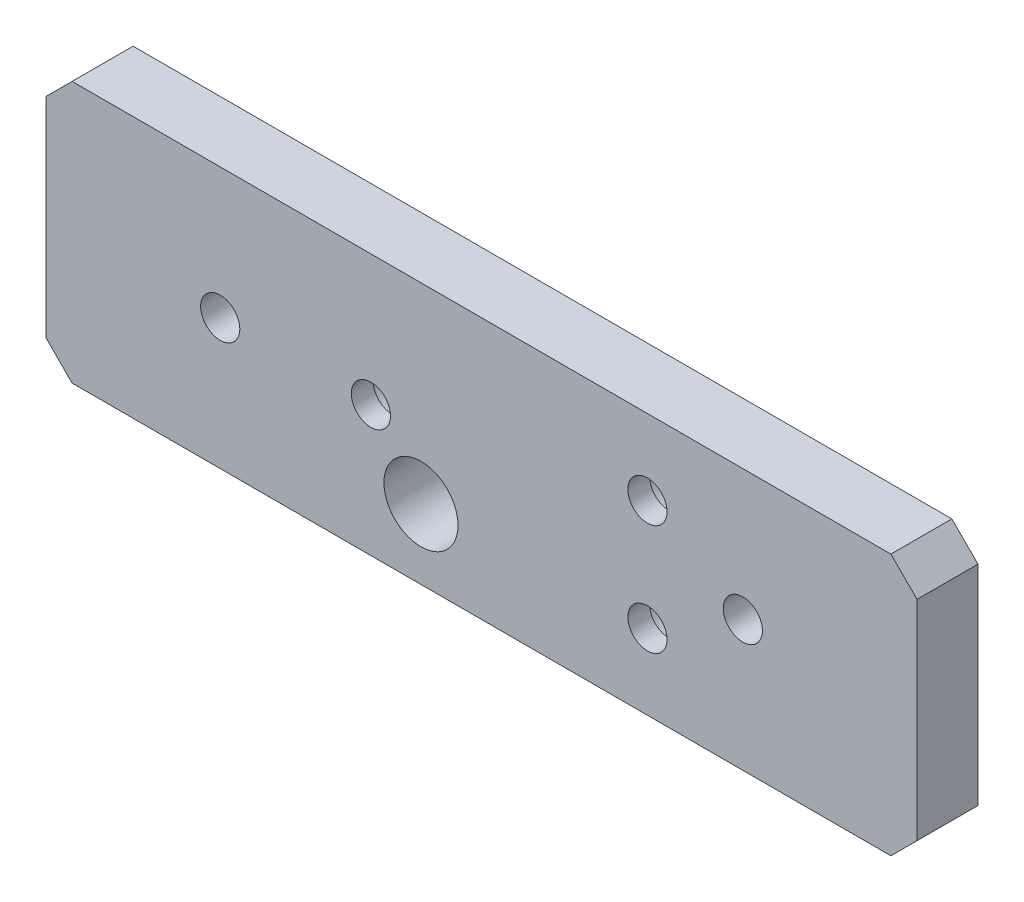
from build123d import *

# Parameters (mm, degrees)
ESQUISSE1_W             = 206
ESQUISSE1_H             = 40
BOSS_EXTRU_1_DEPTH      = 7
ESQUISSE2_W             = 120
ESQUISSE2_H             = 10
ENL_V_MAT_EXTRU_1_DEPTH = 169.95265609
ESQUISSE3_W             = 71.531487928
ESQUISSE3_H             = 26.286301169
ENL_V_MAT_EXTRU_2_DEPTH = 169.95265609
CONG_1_R                = 20
CONG_2_R                = 6
D_GAGEMENT_M41_D        = 4.5
ESQUISSE6_R             = 2.25
ENL_V_MAT_EXTRU_3_DEPTH = 10
ESQUISSE7_R             = 4
ENL_V_MAT_EXTRU_4_DEPTH = 4.5
ESQUISSE8_W             = 108.632741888
ESQUISSE8_H             = 74.254331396
ESQUISSE8_W_2           = 10
ESQUISSE8_H_2           = 30
ENL_V_MAT_EXTRU_5_DEPTH = 169.95265609
CHANFREIN1_SIZE         = 3
ESQUISSE11_R            = 4.25
ENL_V_MAT_EXTRU_6_DEPTH = 10


with BuildPart() as part:
    # Esquisse1 → Boss.-Extru.1 (new body)
    with BuildSketch(Plane.XY):
        with Locations((61, -20)):
            Rectangle(ESQUISSE1_W, ESQUISSE1_H)
    extrude(amount=BOSS_EXTRU_1_DEPTH)

    # Esquisse2 → Enl_v. mat.-Extru.1 (cut, through all)
    with BuildSketch(Plane(origin=(0, 0, 0), x_dir=(-1, 0, 0), z_dir=(0, 0, -1))):
        with Locations((-104, -5)):
            Rectangle(ESQUISSE2_W, ESQUISSE2_H)
    extrude(amount=-ENL_V_MAT_EXTRU_1_DEPTH, mode=Mode.SUBTRACT)

    # Esquisse3 → Enl_v. mat.-Extru.2 (cut, through all)
    with BuildSketch(Plane(origin=(0, 0, 0), x_dir=(-1, 0, 0), z_dir=(0, 0, -1))):
        with Locations((6.234256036, -26.856849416)):
            Rectangle(ESQUISSE3_W, ESQUISSE3_H)
    extrude(amount=-ENL_V_MAT_EXTRU_2_DEPTH, mode=Mode.SUBTRACT)

    # Cong_1
    cong_1_edges = [part.edges().sort_by_distance(p)[0] for p in [
        (29.531487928, -13.713698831, 3.5),
    ]]
    fillet(cong_1_edges, radius=CONG_1_R)

    # Cong_2
    cong_2_edges = [part.edges().sort_by_distance(p)[0] for p in [
        (44, -10, 3.5),
    ]]
    fillet(cong_2_edges, radius=CONG_2_R)

    # D_gagement M41 (through all)
    with Locations(Plane.XY.offset(7)):
        with Locations((134, -25), (74, -25)):
            Hole(D_GAGEMENT_M41_D / 2)

    # Esquisse6 → Enl_v. mat.-Extru.3 (cut)
    with BuildSketch(Plane(origin=(0, 0, 0), x_dir=(-1, 0, 0), z_dir=(0, 0, -1))):
        with Locations((-123.05, -18.65)):
            Circle(ESQUISSE6_R)
        with Locations((-123.05, -31.35)):
            Circle(ESQUISSE6_R)
        with Locations((-91.3, -25)):
            Circle(ESQUISSE6_R)
    extrude(amount=-ENL_V_MAT_EXTRU_3_DEPTH, mode=Mode.SUBTRACT)

    # Esquisse7 → Enl_v. mat.-Extru.4 (cut)
    with BuildSketch(Plane(origin=(0, 0, 0), x_dir=(-1, 0, 0), z_dir=(0, 0, -1))):
        with Locations((-123.05, -31.35)):
            Circle(ESQUISSE7_R)
        with Locations((-123.05, -18.65)):
            Circle(ESQUISSE7_R)
        with Locations((-91.3, -25)):
            Circle(ESQUISSE7_R)
    extrude(amount=-ENL_V_MAT_EXTRU_4_DEPTH, mode=Mode.SUBTRACT)

    # Esquisse8 → Enl_v. mat.-Extru.5 (cut, through all)
    with BuildSketch(Plane(origin=(0, 0, 0), x_dir=(-1, 0, 0), z_dir=(0, 0, -1))):
        with Locations((0.316370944, -25.455291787)):
            Rectangle(ESQUISSE8_W, ESQUISSE8_H)
        with Locations((-159, -25)):
            Rectangle(ESQUISSE8_W_2, ESQUISSE8_H_2)
    extrude(amount=-ENL_V_MAT_EXTRU_5_DEPTH, mode=Mode.SUBTRACT)

    # Chanfrein1
    chanfrein1_edges = [part.edges().sort_by_distance(p)[0] for p in [
        (54, -10, 3.5),
        (54, -40, 3.5),
        (154, -10, 3.5),
        (154, -40, 3.5),
    ]]
    chamfer(chanfrein1_edges, length=CHANFREIN1_SIZE)

    # Esquisse11 → Enl_v. mat.-Extru.6 (cut)
    with BuildSketch(Plane(origin=(0, 0, 0), x_dir=(-1, 0, 0), z_dir=(0, 0, -1))):
        with Locations((-97.05, -32)):
            Circle(ESQUISSE11_R)
    extrude(amount=-ENL_V_MAT_EXTRU_6_DEPTH, mode=Mode.SUBTRACT)


solid = part.part
